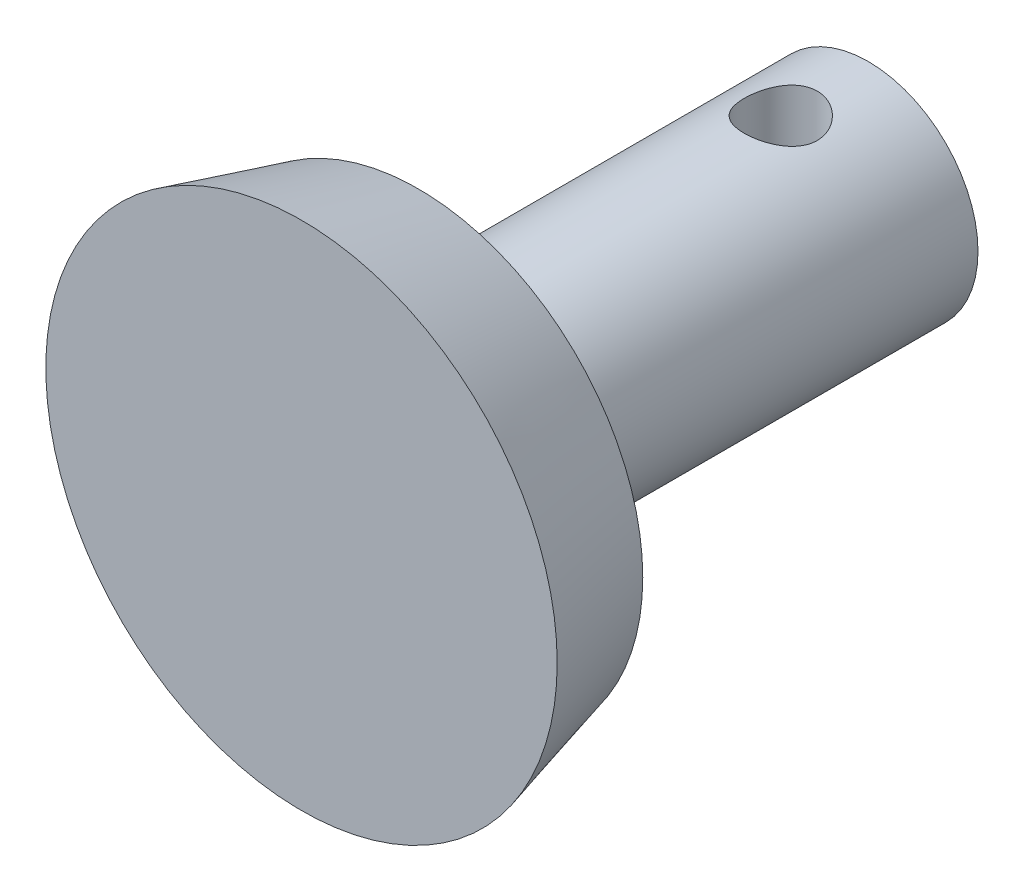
ISO-10303-21;
HEADER;
FILE_DESCRIPTION(('STEP AP214'),'2;1');
FILE_NAME('part.step','',(''),(''),'','','');
FILE_SCHEMA(('AUTOMOTIVE_DESIGN { 1 0 10303 214 1 1 1 1 }'));
ENDSEC;
DATA;
#1=APPLICATION_CONTEXT('core data for automotive mechanical design processes');
#2=APPLICATION_PROTOCOL_DEFINITION('international standard','automotive_design',2000,#1);
#3=PRODUCT_CONTEXT('',#1,'mechanical');
#4=PRODUCT('Part','Part','',(#3));
#5=PRODUCT_RELATED_PRODUCT_CATEGORY('part','',(#4));
#6=PRODUCT_DEFINITION_FORMATION('','',#4);
#7=PRODUCT_DEFINITION_CONTEXT('part definition',#1,'design');
#8=PRODUCT_DEFINITION('design','',#6,#7);
#9=PRODUCT_DEFINITION_SHAPE('','',#8);
#10=(LENGTH_UNIT() NAMED_UNIT(*) SI_UNIT(.MILLI.,.METRE.));
#11=(NAMED_UNIT(*) PLANE_ANGLE_UNIT() SI_UNIT($,.RADIAN.));
#12=(NAMED_UNIT(*) SI_UNIT($,.STERADIAN.) SOLID_ANGLE_UNIT());
#13=UNCERTAINTY_MEASURE_WITH_UNIT(LENGTH_MEASURE(1.E-05),#10,'distance_accuracy_value','');
#14=(GEOMETRIC_REPRESENTATION_CONTEXT(3) GLOBAL_UNCERTAINTY_ASSIGNED_CONTEXT((#13)) GLOBAL_UNIT_ASSIGNED_CONTEXT((#10,
#11,#12)) REPRESENTATION_CONTEXT('',''));
#15=CARTESIAN_POINT('',(0.,0.,0.));
#16=DIRECTION('',(0.,0.,1.));
#17=DIRECTION('',(1.,0.,0.));
#18=AXIS2_PLACEMENT_3D('',#15,#16,#17);
#19=CARTESIAN_POINT('',(0.,0.,-5.08));
#20=DIRECTION('',(0.,0.,1.));
#21=DIRECTION('',(1.,0.,0.));
#22=AXIS2_PLACEMENT_3D('',#19,#20,#21);
#23=PLANE('',#22);
#24=CARTESIAN_POINT('',(0.,0.,-5.08));
#25=DIRECTION('',(0.,0.,1.));
#26=DIRECTION('',(1.,0.,0.));
#27=AXIS2_PLACEMENT_3D('',#24,#25,#26);
#28=CIRCLE('',#27,9.75131810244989);
#29=CARTESIAN_POINT('',(9.75131810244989,0.,-5.08));
#30=VERTEX_POINT('',#29);
#31=EDGE_CURVE('E45',#30,#30,#28,.T.);
#32=ORIENTED_EDGE('',*,*,#31,.F.);
#33=EDGE_LOOP('',(#32));
#34=FACE_BOUND('',#33,.T.);
#35=CARTESIAN_POINT('',(0.,0.,-5.08));
#36=DIRECTION('',(0.,0.,1.));
#37=DIRECTION('',(1.,0.,0.));
#38=AXIS2_PLACEMENT_3D('',#35,#36,#37);
#39=CIRCLE('',#38,4.7625);
#40=CARTESIAN_POINT('',(4.7625,0.,-5.08));
#41=VERTEX_POINT('',#40);
#42=EDGE_CURVE('E10',#41,#41,#39,.F.);
#43=ORIENTED_EDGE('',*,*,#42,.F.);
#44=EDGE_LOOP('',(#43));
#45=FACE_BOUND('',#44,.T.);
#46=ADVANCED_FACE('F33',(#34,#45),#23,.F.);
#47=CARTESIAN_POINT('',(0.,0.,0.));
#48=DIRECTION('',(0.,0.,1.));
#49=DIRECTION('',(1.,0.,0.));
#50=AXIS2_PLACEMENT_3D('',#47,#48,#49);
#51=CONICAL_SURFACE('',#50,11.1125,0.26179938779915);
#52=ORIENTED_EDGE('',*,*,#31,.T.);
#53=EDGE_LOOP('',(#52));
#54=FACE_BOUND('',#53,.T.);
#55=CARTESIAN_POINT('',(0.,0.,0.));
#56=DIRECTION('',(0.,0.,1.));
#57=DIRECTION('',(1.,0.,0.));
#58=AXIS2_PLACEMENT_3D('',#55,#56,#57);
#59=CIRCLE('',#58,11.1125);
#60=CARTESIAN_POINT('',(11.1125,0.,0.));
#61=VERTEX_POINT('',#60);
#62=EDGE_CURVE('E50',#61,#61,#59,.T.);
#63=ORIENTED_EDGE('',*,*,#62,.F.);
#64=EDGE_LOOP('',(#63));
#65=FACE_BOUND('',#64,.T.);
#66=ADVANCED_FACE('F35',(#54,#65),#51,.T.);
#67=CARTESIAN_POINT('',(0.,0.,0.));
#68=DIRECTION('',(0.,0.,1.));
#69=DIRECTION('',(1.,0.,0.));
#70=AXIS2_PLACEMENT_3D('',#67,#68,#69);
#71=PLANE('',#70);
#72=ORIENTED_EDGE('',*,*,#62,.T.);
#73=EDGE_LOOP('',(#72));
#74=FACE_BOUND('',#73,.T.);
#75=ADVANCED_FACE('F72',(#74),#71,.T.);
#76=CARTESIAN_POINT('',(0.,0.,-24.638));
#77=DIRECTION('',(0.,0.,1.));
#78=DIRECTION('',(1.,0.,0.));
#79=AXIS2_PLACEMENT_3D('',#76,#77,#78);
#80=CYLINDRICAL_SURFACE('',#79,4.7625);
#81=CARTESIAN_POINT('',(0.,-4.7625,-19.2405));
#82=CARTESIAN_POINT('',(0.0866193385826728,-4.76250024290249,-19.240499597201));
#83=CARTESIAN_POINT('',(0.173236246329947,-4.76011509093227,-19.247612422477));
#84=CARTESIAN_POINT('',(0.343918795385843,-4.75083521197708,-19.2757887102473));
#85=CARTESIAN_POINT('',(0.427984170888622,-4.74394001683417,-19.2968536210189));
#86=CARTESIAN_POINT('',(0.591078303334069,-4.72638926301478,-19.3521317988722));
#87=CARTESIAN_POINT('',(0.670115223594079,-4.7157399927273,-19.3863230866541));
#88=CARTESIAN_POINT('',(0.821332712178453,-4.6917680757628,-19.4667841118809));
#89=CARTESIAN_POINT('',(0.893511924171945,-4.67844490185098,-19.5130562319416));
#90=CARTESIAN_POINT('',(1.03146490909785,-4.65001124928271,-19.6180484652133));
#91=CARTESIAN_POINT('',(1.09696837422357,-4.63485795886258,-19.6771120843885));
#92=CARTESIAN_POINT('',(1.21734689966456,-4.60470749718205,-19.8052803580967));
#93=CARTESIAN_POINT('',(1.27221961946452,-4.58971036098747,-19.874387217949));
#94=CARTESIAN_POINT('',(1.37132209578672,-4.56109915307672,-20.0231138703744));
#95=CARTESIAN_POINT('',(1.41520046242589,-4.54753724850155,-20.1029788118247));
#96=CARTESIAN_POINT('',(1.48878746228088,-4.52398297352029,-20.2694795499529));
#97=CARTESIAN_POINT('',(1.51850041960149,-4.51398951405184,-20.3561132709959));
#98=CARTESIAN_POINT('',(1.5618991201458,-4.49915443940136,-20.530618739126));
#99=CARTESIAN_POINT('',(1.57609134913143,-4.49415052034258,-20.6183503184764));
#100=CARTESIAN_POINT('',(1.58962903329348,-4.48938104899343,-20.7950812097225));
#101=CARTESIAN_POINT('',(1.58897907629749,-4.48961387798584,-20.8840801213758));
#102=CARTESIAN_POINT('',(1.57324409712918,-4.49514936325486,-21.0564994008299));
#103=CARTESIAN_POINT('',(1.5588200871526,-4.50021985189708,-21.1399888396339));
#104=CARTESIAN_POINT('',(1.51702478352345,-4.51447944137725,-21.3032870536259));
#105=CARTESIAN_POINT('',(1.48965193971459,-4.52366903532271,-21.3830953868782));
#106=CARTESIAN_POINT('',(1.42230325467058,-4.54529683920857,-21.5382677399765));
#107=CARTESIAN_POINT('',(1.38213155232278,-4.55778498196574,-21.6135394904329));
#108=CARTESIAN_POINT('',(1.29046145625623,-4.58458186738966,-21.7564825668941));
#109=CARTESIAN_POINT('',(1.23895979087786,-4.59889113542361,-21.8241516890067));
#110=CARTESIAN_POINT('',(1.12291706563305,-4.62863135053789,-21.9536829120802));
#111=CARTESIAN_POINT('',(1.05783562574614,-4.64408185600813,-22.0150574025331));
#112=CARTESIAN_POINT('',(0.918114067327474,-4.67371014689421,-22.1261483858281));
#113=CARTESIAN_POINT('',(0.843473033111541,-4.68788781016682,-22.1758637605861));
#114=CARTESIAN_POINT('',(0.685716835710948,-4.71355908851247,-22.2626178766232));
#115=CARTESIAN_POINT('',(0.602524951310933,-4.72502468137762,-22.2995259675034));
#116=CARTESIAN_POINT('',(0.430639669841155,-4.7437765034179,-22.3586725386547));
#117=CARTESIAN_POINT('',(0.341948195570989,-4.75106418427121,-22.3809161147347));
#118=CARTESIAN_POINT('',(0.165709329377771,-4.76039857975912,-22.4092383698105));
#119=CARTESIAN_POINT('',(0.0782789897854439,-4.76265877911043,-22.4159759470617));
#120=CARTESIAN_POINT('',(-0.0964804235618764,-4.76232383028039,-22.4149718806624));
#121=CARTESIAN_POINT('',(-0.183809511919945,-4.75972950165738,-22.4072326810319));
#122=CARTESIAN_POINT('',(-0.353250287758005,-4.75011789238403,-22.3780160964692));
#123=CARTESIAN_POINT('',(-0.435439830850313,-4.74323090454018,-22.3569431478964));
#124=CARTESIAN_POINT('',(-0.595083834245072,-4.72585806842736,-22.3021629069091));
#125=CARTESIAN_POINT('',(-0.672537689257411,-4.71537176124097,-22.2684540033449));
#126=CARTESIAN_POINT('',(-0.82278267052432,-4.69152178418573,-22.1883756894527));
#127=CARTESIAN_POINT('',(-0.89539756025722,-4.6780896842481,-22.141696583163));
#128=CARTESIAN_POINT('',(-1.03197791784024,-4.64987090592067,-22.0373667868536));
#129=CARTESIAN_POINT('',(-1.09594073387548,-4.63508381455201,-21.9797127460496));
#130=CARTESIAN_POINT('',(-1.2164258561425,-4.60496996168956,-21.851971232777));
#131=CARTESIAN_POINT('',(-1.27247803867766,-4.58964920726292,-21.7814378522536));
#132=CARTESIAN_POINT('',(-1.37200881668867,-4.5608870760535,-21.6316376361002));
#133=CARTESIAN_POINT('',(-1.41548730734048,-4.54744571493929,-21.5523707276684));
#134=CARTESIAN_POINT('',(-1.48843512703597,-4.52409546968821,-21.3873190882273));
#135=CARTESIAN_POINT('',(-1.51793278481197,-4.51417945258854,-21.3015479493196));
#136=CARTESIAN_POINT('',(-1.56193278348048,-4.49914696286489,-21.1258488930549));
#137=CARTESIAN_POINT('',(-1.57644187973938,-4.49402832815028,-21.0359228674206));
#138=CARTESIAN_POINT('',(-1.58952609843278,-4.48941600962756,-20.859437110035));
#139=CARTESIAN_POINT('',(-1.58888153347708,-4.48964685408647,-20.7729417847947));
#140=CARTESIAN_POINT('',(-1.5735971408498,-4.49502640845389,-20.6013604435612));
#141=CARTESIAN_POINT('',(-1.5589581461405,-4.50017482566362,-20.5162743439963));
#142=CARTESIAN_POINT('',(-1.51665275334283,-4.51460432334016,-20.3515346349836));
#143=CARTESIAN_POINT('',(-1.48923906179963,-4.52380505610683,-20.2718085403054));
#144=CARTESIAN_POINT('',(-1.4223672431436,-4.54527283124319,-20.1180264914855));
#145=CARTESIAN_POINT('',(-1.38290644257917,-4.55754055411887,-20.043971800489));
#146=CARTESIAN_POINT('',(-1.29105134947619,-4.58442741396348,-19.9001321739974));
#147=CARTESIAN_POINT('',(-1.23816783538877,-4.59912579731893,-19.8306745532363));
#148=CARTESIAN_POINT('',(-1.12179557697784,-4.62888578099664,-19.7013674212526));
#149=CARTESIAN_POINT('',(-1.05830383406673,-4.64394748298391,-19.6415206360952));
#150=CARTESIAN_POINT('',(-0.919545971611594,-4.67344173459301,-19.5307832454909));
#151=CARTESIAN_POINT('',(-0.84391740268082,-4.68782688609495,-19.4803325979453));
#152=CARTESIAN_POINT('',(-0.684779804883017,-4.71370010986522,-19.3929151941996));
#153=CARTESIAN_POINT('',(-0.601272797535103,-4.72518892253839,-19.3559449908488));
#154=CARTESIAN_POINT('',(-0.432583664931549,-4.7435375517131,-19.2980919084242));
#155=CARTESIAN_POINT('',(-0.347643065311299,-4.75058124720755,-19.2765640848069));
#156=CARTESIAN_POINT('',(-0.175133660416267,-4.76006171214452,-19.2477703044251));
#157=CARTESIAN_POINT('',(-0.0875655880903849,-4.76249975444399,-19.2405004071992));
#158=CARTESIAN_POINT('',(0.,-4.7625,-19.2405));
#159=B_SPLINE_CURVE_WITH_KNOTS('',3,(#81,#82,#83,#84,#85,#86,#87,#88,#89,#90,#91,#92,#93,#94,
#95,#96,#97,#98,#99,#100,#101,#102,#103,#104,#105,#106,#107,#108,#109,#110,#111,#112,#113,#114,
#115,#116,#117,#118,#119,#120,#121,#122,#123,#124,#125,#126,#127,#128,#129,#130,#131,#132,#133,
#134,#135,#136,#137,#138,#139,#140,#141,#142,#143,#144,#145,#146,#147,#148,#149,#150,#151,#152,
#153,#154,#155,#156,#157,#158),.UNSPECIFIED.,.T.,.F.,(4,2,2,2,2,2,2,2,2,2,2,2,2,2,2,2,2,2,2,2,2,
2,2,2,2,2,2,2,2,2,2,2,2,2,2,2,2,2,4),(0.,0.259535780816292,0.519098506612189,0.778228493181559,
1.03740962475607,1.30468186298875,1.57201287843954,1.84703060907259,2.12196433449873,
2.38763057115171,2.65321468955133,2.90666212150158,3.16013990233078,3.4176997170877,
3.67533400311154,3.94641872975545,4.21752944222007,4.49132968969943,4.76503474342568,
5.02687563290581,5.2886723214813,5.54288575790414,5.79713161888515,6.05806509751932,
6.31907837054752,6.59195123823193,6.86482638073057,7.13714621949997,7.40934326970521,
7.6675561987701,7.92575375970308,8.17904744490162,8.43239738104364,8.69680230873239,
8.96128210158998,9.23606961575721,9.51078681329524,9.77323036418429,10.0356013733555),.UNSPECIFIED.);
#160=CARTESIAN_POINT('',(0.,-4.7625,-19.2405));
#161=VERTEX_POINT('',#160);
#162=EDGE_CURVE('E37',#161,#161,#159,.T.);
#163=ORIENTED_EDGE('',*,*,#162,.T.);
#164=EDGE_LOOP('',(#163));
#165=FACE_BOUND('',#164,.T.);
#166=CARTESIAN_POINT('',(0.,4.7625,-19.2405));
#167=CARTESIAN_POINT('',(-0.0866193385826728,4.76250024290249,-19.240499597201));
#168=CARTESIAN_POINT('',(-0.173236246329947,4.76011509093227,-19.247612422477));
#169=CARTESIAN_POINT('',(-0.343918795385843,4.75083521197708,-19.2757887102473));
#170=CARTESIAN_POINT('',(-0.427984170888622,4.74394001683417,-19.2968536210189));
#171=CARTESIAN_POINT('',(-0.591078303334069,4.72638926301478,-19.3521317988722));
#172=CARTESIAN_POINT('',(-0.670115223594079,4.7157399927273,-19.3863230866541));
#173=CARTESIAN_POINT('',(-0.821332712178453,4.6917680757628,-19.4667841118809));
#174=CARTESIAN_POINT('',(-0.893511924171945,4.67844490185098,-19.5130562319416));
#175=CARTESIAN_POINT('',(-1.03146490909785,4.65001124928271,-19.6180484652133));
#176=CARTESIAN_POINT('',(-1.09696837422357,4.63485795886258,-19.6771120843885));
#177=CARTESIAN_POINT('',(-1.21734689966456,4.60470749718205,-19.8052803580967));
#178=CARTESIAN_POINT('',(-1.27221961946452,4.58971036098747,-19.874387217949));
#179=CARTESIAN_POINT('',(-1.37132209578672,4.56109915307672,-20.0231138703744));
#180=CARTESIAN_POINT('',(-1.41520046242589,4.54753724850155,-20.1029788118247));
#181=CARTESIAN_POINT('',(-1.48878746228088,4.52398297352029,-20.2694795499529));
#182=CARTESIAN_POINT('',(-1.51850041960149,4.51398951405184,-20.3561132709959));
#183=CARTESIAN_POINT('',(-1.5618991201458,4.49915443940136,-20.530618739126));
#184=CARTESIAN_POINT('',(-1.57609134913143,4.49415052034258,-20.6183503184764));
#185=CARTESIAN_POINT('',(-1.58962903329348,4.48938104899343,-20.7950812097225));
#186=CARTESIAN_POINT('',(-1.58897907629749,4.48961387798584,-20.8840801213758));
#187=CARTESIAN_POINT('',(-1.57324409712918,4.49514936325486,-21.0564994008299));
#188=CARTESIAN_POINT('',(-1.5588200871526,4.50021985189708,-21.1399888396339));
#189=CARTESIAN_POINT('',(-1.51702478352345,4.51447944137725,-21.3032870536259));
#190=CARTESIAN_POINT('',(-1.48965193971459,4.52366903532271,-21.3830953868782));
#191=CARTESIAN_POINT('',(-1.42230325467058,4.54529683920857,-21.5382677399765));
#192=CARTESIAN_POINT('',(-1.38213155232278,4.55778498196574,-21.6135394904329));
#193=CARTESIAN_POINT('',(-1.29046145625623,4.58458186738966,-21.7564825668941));
#194=CARTESIAN_POINT('',(-1.23895979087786,4.59889113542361,-21.8241516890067));
#195=CARTESIAN_POINT('',(-1.12291706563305,4.62863135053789,-21.9536829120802));
#196=CARTESIAN_POINT('',(-1.05783562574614,4.64408185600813,-22.0150574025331));
#197=CARTESIAN_POINT('',(-0.918114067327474,4.67371014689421,-22.1261483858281));
#198=CARTESIAN_POINT('',(-0.843473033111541,4.68788781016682,-22.1758637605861));
#199=CARTESIAN_POINT('',(-0.685716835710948,4.71355908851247,-22.2626178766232));
#200=CARTESIAN_POINT('',(-0.602524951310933,4.72502468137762,-22.2995259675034));
#201=CARTESIAN_POINT('',(-0.430639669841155,4.7437765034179,-22.3586725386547));
#202=CARTESIAN_POINT('',(-0.341948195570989,4.75106418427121,-22.3809161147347));
#203=CARTESIAN_POINT('',(-0.165709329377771,4.76039857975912,-22.4092383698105));
#204=CARTESIAN_POINT('',(-0.0782789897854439,4.76265877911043,-22.4159759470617));
#205=CARTESIAN_POINT('',(0.0964804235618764,4.76232383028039,-22.4149718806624));
#206=CARTESIAN_POINT('',(0.183809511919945,4.75972950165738,-22.4072326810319));
#207=CARTESIAN_POINT('',(0.353250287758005,4.75011789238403,-22.3780160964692));
#208=CARTESIAN_POINT('',(0.435439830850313,4.74323090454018,-22.3569431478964));
#209=CARTESIAN_POINT('',(0.595083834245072,4.72585806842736,-22.3021629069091));
#210=CARTESIAN_POINT('',(0.672537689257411,4.71537176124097,-22.2684540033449));
#211=CARTESIAN_POINT('',(0.82278267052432,4.69152178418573,-22.1883756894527));
#212=CARTESIAN_POINT('',(0.89539756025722,4.6780896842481,-22.141696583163));
#213=CARTESIAN_POINT('',(1.03197791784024,4.64987090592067,-22.0373667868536));
#214=CARTESIAN_POINT('',(1.09594073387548,4.63508381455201,-21.9797127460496));
#215=CARTESIAN_POINT('',(1.2164258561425,4.60496996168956,-21.851971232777));
#216=CARTESIAN_POINT('',(1.27247803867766,4.58964920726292,-21.7814378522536));
#217=CARTESIAN_POINT('',(1.37200881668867,4.5608870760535,-21.6316376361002));
#218=CARTESIAN_POINT('',(1.41548730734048,4.54744571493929,-21.5523707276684));
#219=CARTESIAN_POINT('',(1.48843512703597,4.52409546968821,-21.3873190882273));
#220=CARTESIAN_POINT('',(1.51793278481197,4.51417945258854,-21.3015479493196));
#221=CARTESIAN_POINT('',(1.56193278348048,4.49914696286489,-21.1258488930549));
#222=CARTESIAN_POINT('',(1.57644187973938,4.49402832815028,-21.0359228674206));
#223=CARTESIAN_POINT('',(1.58952609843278,4.48941600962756,-20.859437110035));
#224=CARTESIAN_POINT('',(1.58888153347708,4.48964685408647,-20.7729417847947));
#225=CARTESIAN_POINT('',(1.5735971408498,4.49502640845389,-20.6013604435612));
#226=CARTESIAN_POINT('',(1.5589581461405,4.50017482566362,-20.5162743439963));
#227=CARTESIAN_POINT('',(1.51665275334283,4.51460432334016,-20.3515346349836));
#228=CARTESIAN_POINT('',(1.48923906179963,4.52380505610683,-20.2718085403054));
#229=CARTESIAN_POINT('',(1.4223672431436,4.54527283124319,-20.1180264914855));
#230=CARTESIAN_POINT('',(1.38290644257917,4.55754055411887,-20.043971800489));
#231=CARTESIAN_POINT('',(1.29105134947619,4.58442741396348,-19.9001321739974));
#232=CARTESIAN_POINT('',(1.23816783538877,4.59912579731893,-19.8306745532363));
#233=CARTESIAN_POINT('',(1.12179557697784,4.62888578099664,-19.7013674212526));
#234=CARTESIAN_POINT('',(1.05830383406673,4.64394748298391,-19.6415206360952));
#235=CARTESIAN_POINT('',(0.919545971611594,4.67344173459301,-19.5307832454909));
#236=CARTESIAN_POINT('',(0.84391740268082,4.68782688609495,-19.4803325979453));
#237=CARTESIAN_POINT('',(0.684779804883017,4.71370010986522,-19.3929151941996));
#238=CARTESIAN_POINT('',(0.601272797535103,4.72518892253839,-19.3559449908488));
#239=CARTESIAN_POINT('',(0.432583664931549,4.7435375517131,-19.2980919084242));
#240=CARTESIAN_POINT('',(0.347643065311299,4.75058124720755,-19.2765640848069));
#241=CARTESIAN_POINT('',(0.175133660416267,4.76006171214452,-19.2477703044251));
#242=CARTESIAN_POINT('',(0.0875655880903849,4.76249975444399,-19.2405004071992));
#243=CARTESIAN_POINT('',(0.,4.7625,-19.2405));
#244=B_SPLINE_CURVE_WITH_KNOTS('',3,(#166,#167,#168,#169,#170,#171,#172,#173,#174,#175,#176,
#177,#178,#179,#180,#181,#182,#183,#184,#185,#186,#187,#188,#189,#190,#191,#192,#193,#194,#195,
#196,#197,#198,#199,#200,#201,#202,#203,#204,#205,#206,#207,#208,#209,#210,#211,#212,#213,#214,
#215,#216,#217,#218,#219,#220,#221,#222,#223,#224,#225,#226,#227,#228,#229,#230,#231,#232,#233,
#234,#235,#236,#237,#238,#239,#240,#241,#242,#243),.UNSPECIFIED.,.T.,.F.,(4,2,2,2,2,2,2,2,2,2,2,
2,2,2,2,2,2,2,2,2,2,2,2,2,2,2,2,2,2,2,2,2,2,2,2,2,2,2,4),(0.,0.259535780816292,
0.519098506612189,0.778228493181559,1.03740962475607,1.30468186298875,1.57201287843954,
1.84703060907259,2.12196433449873,2.38763057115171,2.65321468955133,2.90666212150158,
3.16013990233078,3.4176997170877,3.67533400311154,3.94641872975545,4.21752944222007,
4.49132968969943,4.76503474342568,5.02687563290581,5.2886723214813,5.54288575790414,
5.79713161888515,6.05806509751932,6.31907837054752,6.59195123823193,6.86482638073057,
7.13714621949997,7.40934326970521,7.6675561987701,7.92575375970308,8.17904744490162,
8.43239738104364,8.69680230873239,8.96128210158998,9.23606961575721,9.51078681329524,
9.77323036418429,10.0356013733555),.UNSPECIFIED.);
#245=CARTESIAN_POINT('',(0.,4.7625,-19.2405));
#246=VERTEX_POINT('',#245);
#247=EDGE_CURVE('E53',#246,#246,#244,.T.);
#248=ORIENTED_EDGE('',*,*,#247,.T.);
#249=EDGE_LOOP('',(#248));
#250=FACE_BOUND('',#249,.T.);
#251=CARTESIAN_POINT('',(0.,0.,-24.638));
#252=DIRECTION('',(0.,0.,-1.));
#253=DIRECTION('',(-1.,0.,0.));
#254=AXIS2_PLACEMENT_3D('',#251,#252,#253);
#255=CIRCLE('',#254,4.7625);
#256=CARTESIAN_POINT('',(-4.7625,0.,-24.638));
#257=VERTEX_POINT('',#256);
#258=EDGE_CURVE('E90',#257,#257,#255,.T.);
#259=ORIENTED_EDGE('',*,*,#258,.F.);
#260=EDGE_LOOP('',(#259));
#261=FACE_BOUND('',#260,.T.);
#262=ORIENTED_EDGE('',*,*,#42,.T.);
#263=EDGE_LOOP('',(#262));
#264=FACE_BOUND('',#263,.T.);
#265=ADVANCED_FACE('F57',(#165,#250,#261,#264),#80,.T.);
#266=CARTESIAN_POINT('',(0.,0.,-24.638));
#267=DIRECTION('',(0.,0.,-1.));
#268=DIRECTION('',(-1.,0.,0.));
#269=AXIS2_PLACEMENT_3D('',#266,#267,#268);
#270=PLANE('',#269);
#271=ORIENTED_EDGE('',*,*,#258,.T.);
#272=EDGE_LOOP('',(#271));
#273=FACE_BOUND('',#272,.T.);
#274=ADVANCED_FACE('F64',(#273),#270,.T.);
#275=CARTESIAN_POINT('',(0.,-11.1125,-20.828));
#276=DIRECTION('',(0.,1.,0.));
#277=DIRECTION('',(0.,0.,1.));
#278=AXIS2_PLACEMENT_3D('',#275,#276,#277);
#279=CYLINDRICAL_SURFACE('',#278,1.5875);
#280=ORIENTED_EDGE('',*,*,#247,.F.);
#281=EDGE_LOOP('',(#280));
#282=FACE_BOUND('',#281,.T.);
#283=ORIENTED_EDGE('',*,*,#162,.F.);
#284=EDGE_LOOP('',(#283));
#285=FACE_BOUND('',#284,.T.);
#286=ADVANCED_FACE('F61',(#282,#285),#279,.F.);
#287=CLOSED_SHELL('',(#46,#66,#75,#265,#274,#286));
#288=MANIFOLD_SOLID_BREP('B2',#287);
#289=ADVANCED_BREP_SHAPE_REPRESENTATION('',(#18,#288),#14);
#290=SHAPE_DEFINITION_REPRESENTATION(#9,#289);
ENDSEC;
END-ISO-10303-21;
